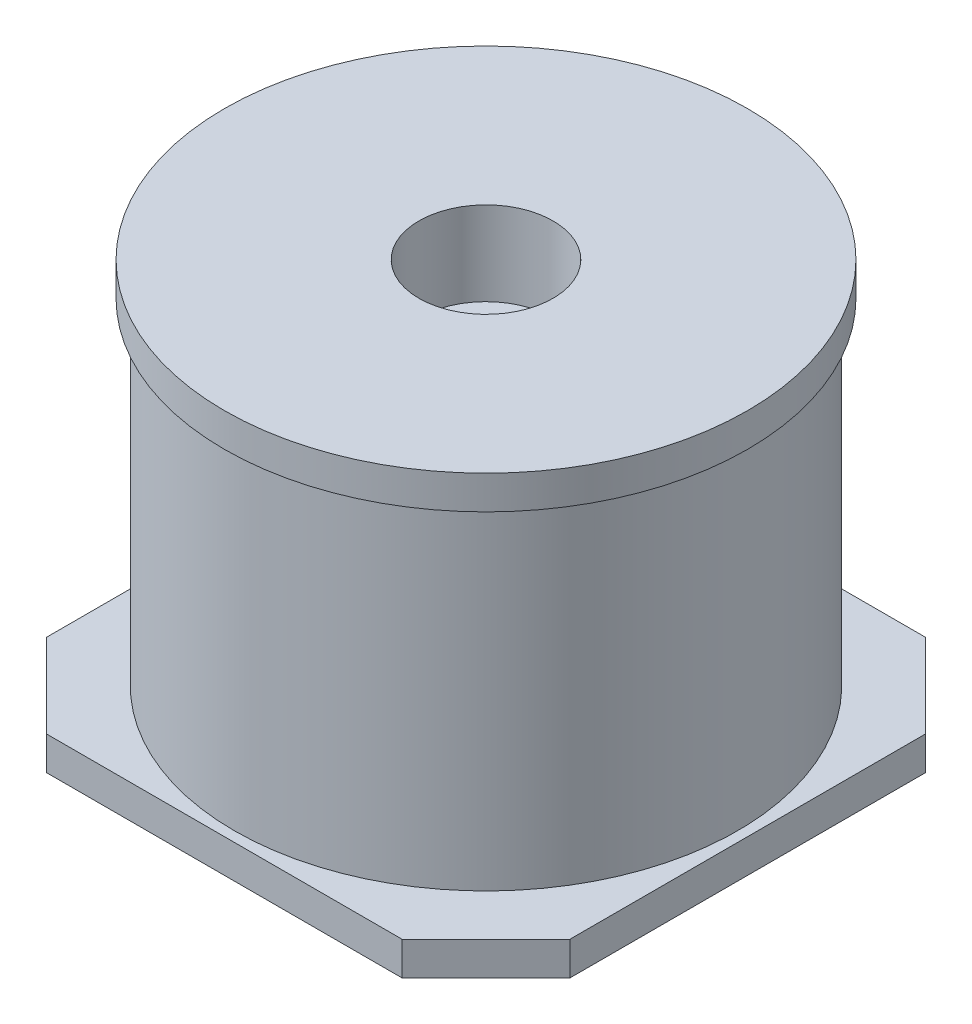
from build123d import *

# Parameters (mm, degrees)
SKETCH1_R           = 3.81
BOSS_EXTRUDE1_DEPTH = 5.08
SKETCH2_R           = 3.9624
BOSS_EXTRUDE2_DEPTH = 0.508
SKETCH3_R           = 1.016
CUT_EXTRUDE1_DEPTH  = 1.27
BOSS_EXTRUDE3_DEPTH = 0.508
CUT_EXTRUDE2_START  = -1.27
SKETCH5_R           = 1.016
CUT_EXTRUDE2_DEPTH  = 1.27


with BuildPart() as part:
    # Sketch1 → Boss-Extrude1 (new body)
    with BuildSketch(Plane(origin=(0, 0, 0), x_dir=(1, 0, 0), z_dir=(0, 1, 0))):
        with Locations(Location((0, 0, 0), (0, 0, 270))):
            Circle(SKETCH1_R)
    extrude(amount=BOSS_EXTRUDE1_DEPTH)

    # Sketch2 → Boss-Extrude2 (add)
    with BuildSketch(Plane(origin=(0, 5.08, 0), x_dir=(1, 0, 0), z_dir=(0, 1, 0))):
        with Locations(Location((0, 0, 0), (0, 0, 270))):
            Circle(SKETCH2_R)
    extrude(amount=BOSS_EXTRUDE2_DEPTH)

    # Sketch3 → Cut-Extrude1 (cut)
    with BuildSketch(Plane(origin=(0, 5.588, 0), x_dir=(1, 0, 0), z_dir=(0, 1, 0))):
        with Locations(Location((0, 0, 0), (0, 0, 270))):
            Circle(SKETCH3_R)
    extrude(amount=-CUT_EXTRUDE1_DEPTH, mode=Mode.SUBTRACT)

    # Sketch4 → Boss-Extrude3 (add)
    with BuildSketch(Plane.XZ):
        Polygon((-3.9624, 2.6924), (-2.6924, 3.9624), (2.6924, 3.9624), (3.9624, 2.6924), (3.9624, -2.6924), (2.6924, -3.9624), (-2.6924, -3.9624), (-3.9624, -2.6924), align=None)
    extrude(amount=BOSS_EXTRUDE3_DEPTH)

    # Sketch5 → Cut-Extrude2 (cut)
    with BuildSketch(Plane.XZ.offset(0.508).offset(CUT_EXTRUDE2_START)):
        with Locations(Location((0, 0, 0), (0, 0, 90))):
            Circle(SKETCH5_R)
    extrude(amount=CUT_EXTRUDE2_DEPTH, mode=Mode.SUBTRACT)


solid = part.part
